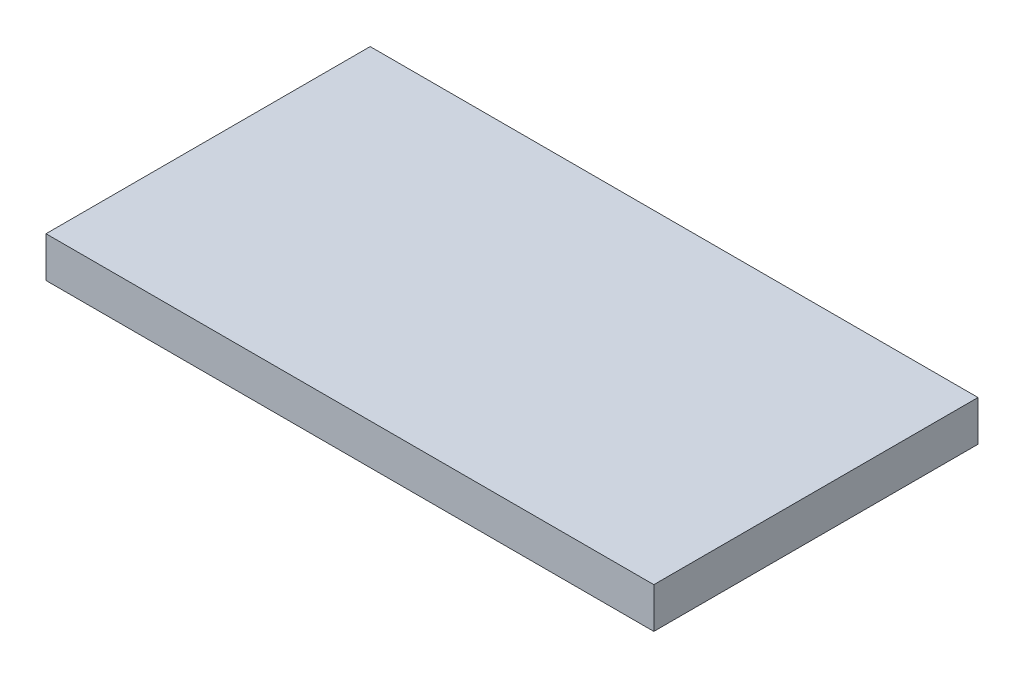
ISO-10303-21;
HEADER;
FILE_DESCRIPTION(('STEP AP214'),'2;1');
FILE_NAME('part.step','',(''),(''),'','','');
FILE_SCHEMA(('AUTOMOTIVE_DESIGN { 1 0 10303 214 1 1 1 1 }'));
ENDSEC;
DATA;
#1=APPLICATION_CONTEXT('core data for automotive mechanical design processes');
#2=APPLICATION_PROTOCOL_DEFINITION('international standard','automotive_design',2000,#1);
#3=PRODUCT_CONTEXT('',#1,'mechanical');
#4=PRODUCT('Part','Part','',(#3));
#5=PRODUCT_RELATED_PRODUCT_CATEGORY('part','',(#4));
#6=PRODUCT_DEFINITION_FORMATION('','',#4);
#7=PRODUCT_DEFINITION_CONTEXT('part definition',#1,'design');
#8=PRODUCT_DEFINITION('design','',#6,#7);
#9=PRODUCT_DEFINITION_SHAPE('','',#8);
#10=(LENGTH_UNIT() NAMED_UNIT(*) SI_UNIT(.MILLI.,.METRE.));
#11=(NAMED_UNIT(*) PLANE_ANGLE_UNIT() SI_UNIT($,.RADIAN.));
#12=(NAMED_UNIT(*) SI_UNIT($,.STERADIAN.) SOLID_ANGLE_UNIT());
#13=UNCERTAINTY_MEASURE_WITH_UNIT(LENGTH_MEASURE(1.E-05),#10,'distance_accuracy_value','');
#14=(GEOMETRIC_REPRESENTATION_CONTEXT(3) GLOBAL_UNCERTAINTY_ASSIGNED_CONTEXT((#13)) GLOBAL_UNIT_ASSIGNED_CONTEXT((#10,
#11,#12)) REPRESENTATION_CONTEXT('',''));
#15=CARTESIAN_POINT('',(0.,0.,0.));
#16=DIRECTION('',(0.,0.,1.));
#17=DIRECTION('',(1.,0.,0.));
#18=AXIS2_PLACEMENT_3D('',#15,#16,#17);
#19=CARTESIAN_POINT('',(75.,10.,40.));
#20=DIRECTION('',(-1.,0.,0.));
#21=DIRECTION('',(0.,0.,1.));
#22=AXIS2_PLACEMENT_3D('',#19,#20,#21);
#23=PLANE('',#22);
#24=DIRECTION('',(0.,0.,-1.));
#25=VECTOR('',#24,1.);
#26=CARTESIAN_POINT('',(75.,0.,40.));
#27=LINE('',#26,#25);
#28=CARTESIAN_POINT('',(75.,0.,40.));
#29=VERTEX_POINT('',#28);
#30=CARTESIAN_POINT('',(75.,0.,-40.));
#31=VERTEX_POINT('',#30);
#32=EDGE_CURVE('E96',#29,#31,#27,.T.);
#33=ORIENTED_EDGE('',*,*,#32,.T.);
#34=DIRECTION('',(0.,-1.,0.));
#35=VECTOR('',#34,1.);
#36=CARTESIAN_POINT('',(75.,10.,-40.));
#37=LINE('',#36,#35);
#38=CARTESIAN_POINT('',(75.,10.,-40.));
#39=VERTEX_POINT('',#38);
#40=EDGE_CURVE('E11',#39,#31,#37,.T.);
#41=ORIENTED_EDGE('',*,*,#40,.F.);
#42=DIRECTION('',(0.,0.,-1.));
#43=VECTOR('',#42,1.);
#44=CARTESIAN_POINT('',(75.,10.,40.));
#45=LINE('',#44,#43);
#46=CARTESIAN_POINT('',(75.,10.,40.));
#47=VERTEX_POINT('',#46);
#48=EDGE_CURVE('E84',#47,#39,#45,.T.);
#49=ORIENTED_EDGE('',*,*,#48,.F.);
#50=DIRECTION('',(0.,-1.,0.));
#51=VECTOR('',#50,1.);
#52=CARTESIAN_POINT('',(75.,10.,40.));
#53=LINE('',#52,#51);
#54=EDGE_CURVE('E92',#47,#29,#53,.T.);
#55=ORIENTED_EDGE('',*,*,#54,.T.);
#56=EDGE_LOOP('',(#33,#41,#49,#55));
#57=FACE_BOUND('',#56,.T.);
#58=ADVANCED_FACE('F33',(#57),#23,.F.);
#59=CARTESIAN_POINT('',(-75.,10.,-40.));
#60=DIRECTION('',(0.,0.,1.));
#61=DIRECTION('',(1.,0.,0.));
#62=AXIS2_PLACEMENT_3D('',#59,#60,#61);
#63=PLANE('',#62);
#64=DIRECTION('',(-1.,0.,0.));
#65=VECTOR('',#64,1.);
#66=CARTESIAN_POINT('',(-75.,0.,-40.));
#67=LINE('',#66,#65);
#68=CARTESIAN_POINT('',(-75.,0.,-40.));
#69=VERTEX_POINT('',#68);
#70=EDGE_CURVE('E88',#31,#69,#67,.T.);
#71=ORIENTED_EDGE('',*,*,#70,.T.);
#72=DIRECTION('',(0.,-1.,0.));
#73=VECTOR('',#72,1.);
#74=CARTESIAN_POINT('',(-75.,10.,-40.));
#75=LINE('',#74,#73);
#76=CARTESIAN_POINT('',(-75.,10.,-40.));
#77=VERTEX_POINT('',#76);
#78=EDGE_CURVE('E41',#77,#69,#75,.T.);
#79=ORIENTED_EDGE('',*,*,#78,.F.);
#80=DIRECTION('',(-1.,0.,0.));
#81=VECTOR('',#80,1.);
#82=CARTESIAN_POINT('',(-75.,10.,-40.));
#83=LINE('',#82,#81);
#84=EDGE_CURVE('E79',#39,#77,#83,.T.);
#85=ORIENTED_EDGE('',*,*,#84,.F.);
#86=ORIENTED_EDGE('',*,*,#40,.T.);
#87=EDGE_LOOP('',(#71,#79,#85,#86));
#88=FACE_BOUND('',#87,.T.);
#89=ADVANCED_FACE('F87',(#88),#63,.F.);
#90=CARTESIAN_POINT('',(-75.,10.,40.));
#91=DIRECTION('',(1.,0.,0.));
#92=DIRECTION('',(0.,0.,-1.));
#93=AXIS2_PLACEMENT_3D('',#90,#91,#92);
#94=PLANE('',#93);
#95=DIRECTION('',(0.,0.,1.));
#96=VECTOR('',#95,1.);
#97=CARTESIAN_POINT('',(-75.,0.,40.));
#98=LINE('',#97,#96);
#99=CARTESIAN_POINT('',(-75.,0.,40.));
#100=VERTEX_POINT('',#99);
#101=EDGE_CURVE('E66',#69,#100,#98,.T.);
#102=ORIENTED_EDGE('',*,*,#101,.T.);
#103=DIRECTION('',(0.,-1.,0.));
#104=VECTOR('',#103,1.);
#105=CARTESIAN_POINT('',(-75.,10.,40.));
#106=LINE('',#105,#104);
#107=CARTESIAN_POINT('',(-75.,10.,40.));
#108=VERTEX_POINT('',#107);
#109=EDGE_CURVE('E89',#108,#100,#106,.T.);
#110=ORIENTED_EDGE('',*,*,#109,.F.);
#111=DIRECTION('',(0.,0.,1.));
#112=VECTOR('',#111,1.);
#113=CARTESIAN_POINT('',(-75.,10.,40.));
#114=LINE('',#113,#112);
#115=EDGE_CURVE('E82',#77,#108,#114,.T.);
#116=ORIENTED_EDGE('',*,*,#115,.F.);
#117=ORIENTED_EDGE('',*,*,#78,.T.);
#118=EDGE_LOOP('',(#102,#110,#116,#117));
#119=FACE_BOUND('',#118,.T.);
#120=ADVANCED_FACE('F90',(#119),#94,.F.);
#121=CARTESIAN_POINT('',(-75.,10.,40.));
#122=DIRECTION('',(0.,0.,-1.));
#123=DIRECTION('',(-1.,0.,0.));
#124=AXIS2_PLACEMENT_3D('',#121,#122,#123);
#125=PLANE('',#124);
#126=DIRECTION('',(1.,0.,0.));
#127=VECTOR('',#126,1.);
#128=CARTESIAN_POINT('',(-75.,0.,40.));
#129=LINE('',#128,#127);
#130=EDGE_CURVE('E72',#100,#29,#129,.T.);
#131=ORIENTED_EDGE('',*,*,#130,.T.);
#132=ORIENTED_EDGE('',*,*,#54,.F.);
#133=DIRECTION('',(1.,0.,0.));
#134=VECTOR('',#133,1.);
#135=CARTESIAN_POINT('',(-75.,10.,40.));
#136=LINE('',#135,#134);
#137=EDGE_CURVE('E49',#108,#47,#136,.T.);
#138=ORIENTED_EDGE('',*,*,#137,.F.);
#139=ORIENTED_EDGE('',*,*,#109,.T.);
#140=EDGE_LOOP('',(#131,#132,#138,#139));
#141=FACE_BOUND('',#140,.T.);
#142=ADVANCED_FACE('F103',(#141),#125,.F.);
#143=CARTESIAN_POINT('',(0.,10.,0.));
#144=DIRECTION('',(0.,-1.,0.));
#145=DIRECTION('',(0.,0.,-1.));
#146=AXIS2_PLACEMENT_3D('',#143,#144,#145);
#147=PLANE('',#146);
#148=ORIENTED_EDGE('',*,*,#48,.T.);
#149=ORIENTED_EDGE('',*,*,#84,.T.);
#150=ORIENTED_EDGE('',*,*,#115,.T.);
#151=ORIENTED_EDGE('',*,*,#137,.T.);
#152=EDGE_LOOP('',(#148,#149,#150,#151));
#153=FACE_BOUND('',#152,.T.);
#154=ADVANCED_FACE('F80',(#153),#147,.F.);
#155=CARTESIAN_POINT('',(0.,0.,0.));
#156=DIRECTION('',(0.,-1.,0.));
#157=DIRECTION('',(0.,0.,-1.));
#158=AXIS2_PLACEMENT_3D('',#155,#156,#157);
#159=PLANE('',#158);
#160=ORIENTED_EDGE('',*,*,#32,.F.);
#161=ORIENTED_EDGE('',*,*,#130,.F.);
#162=ORIENTED_EDGE('',*,*,#101,.F.);
#163=ORIENTED_EDGE('',*,*,#70,.F.);
#164=EDGE_LOOP('',(#160,#161,#162,#163));
#165=FACE_BOUND('',#164,.T.);
#166=ADVANCED_FACE('F106',(#165),#159,.T.);
#167=CLOSED_SHELL('',(#58,#89,#120,#142,#154,#166));
#168=MANIFOLD_SOLID_BREP('B2',#167);
#169=ADVANCED_BREP_SHAPE_REPRESENTATION('',(#18,#168),#14);
#170=SHAPE_DEFINITION_REPRESENTATION(#9,#169);
ENDSEC;
END-ISO-10303-21;
